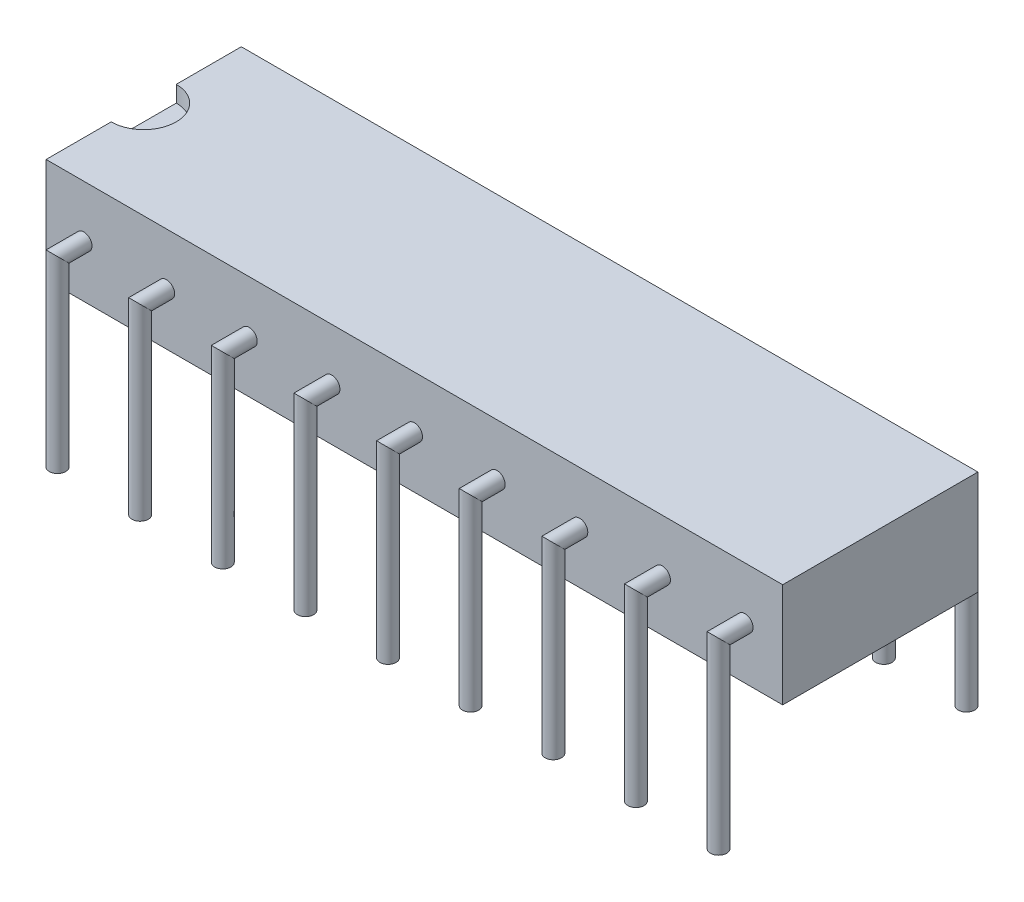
ISO-10303-21;
HEADER;
FILE_DESCRIPTION(('STEP AP214'),'2;1');
FILE_NAME('part.step','',(''),(''),'','','');
FILE_SCHEMA(('AUTOMOTIVE_DESIGN { 1 0 10303 214 1 1 1 1 }'));
ENDSEC;
DATA;
#1=APPLICATION_CONTEXT('core data for automotive mechanical design processes');
#2=APPLICATION_PROTOCOL_DEFINITION('international standard','automotive_design',2000,#1);
#3=PRODUCT_CONTEXT('',#1,'mechanical');
#4=PRODUCT('Part','Part','',(#3));
#5=PRODUCT_RELATED_PRODUCT_CATEGORY('part','',(#4));
#6=PRODUCT_DEFINITION_FORMATION('','',#4);
#7=PRODUCT_DEFINITION_CONTEXT('part definition',#1,'design');
#8=PRODUCT_DEFINITION('design','',#6,#7);
#9=PRODUCT_DEFINITION_SHAPE('','',#8);
#10=(LENGTH_UNIT() NAMED_UNIT(*) SI_UNIT(.MILLI.,.METRE.));
#11=(NAMED_UNIT(*) PLANE_ANGLE_UNIT() SI_UNIT($,.RADIAN.));
#12=(NAMED_UNIT(*) SI_UNIT($,.STERADIAN.) SOLID_ANGLE_UNIT());
#13=UNCERTAINTY_MEASURE_WITH_UNIT(LENGTH_MEASURE(1.E-05),#10,'distance_accuracy_value','');
#14=(GEOMETRIC_REPRESENTATION_CONTEXT(3) GLOBAL_UNCERTAINTY_ASSIGNED_CONTEXT((#13)) GLOBAL_UNIT_ASSIGNED_CONTEXT((#10,
#11,#12)) REPRESENTATION_CONTEXT('',''));
#15=CARTESIAN_POINT('',(0.,0.,0.));
#16=DIRECTION('',(0.,0.,1.));
#17=DIRECTION('',(1.,0.,0.));
#18=AXIS2_PLACEMENT_3D('',#15,#16,#17);
#19=CARTESIAN_POINT('',(22.64,3.2,3.));
#20=DIRECTION('',(0.,0.,-1.));
#21=DIRECTION('',(-1.,0.,0.));
#22=AXIS2_PLACEMENT_3D('',#19,#20,#21);
#23=PLANE('',#22);
#24=CARTESIAN_POINT('',(18.94,1.6,3.));
#25=DIRECTION('',(0.,0.,-1.));
#26=DIRECTION('',(-1.,0.,0.));
#27=AXIS2_PLACEMENT_3D('',#24,#25,#26);
#28=CIRCLE('',#27,0.25);
#29=CARTESIAN_POINT('',(18.69,1.6,3.));
#30=VERTEX_POINT('',#29);
#31=EDGE_CURVE('E59',#30,#30,#28,.F.);
#32=ORIENTED_EDGE('',*,*,#31,.F.);
#33=EDGE_LOOP('',(#32));
#34=FACE_BOUND('',#33,.T.);
#35=CARTESIAN_POINT('',(13.86,1.6,3.));
#36=DIRECTION('',(0.,0.,-1.));
#37=DIRECTION('',(-1.,0.,0.));
#38=AXIS2_PLACEMENT_3D('',#35,#36,#37);
#39=CIRCLE('',#38,0.25);
#40=CARTESIAN_POINT('',(13.61,1.6,3.));
#41=VERTEX_POINT('',#40);
#42=EDGE_CURVE('E171',#41,#41,#39,.F.);
#43=ORIENTED_EDGE('',*,*,#42,.F.);
#44=EDGE_LOOP('',(#43));
#45=FACE_BOUND('',#44,.T.);
#46=CARTESIAN_POINT('',(8.78,1.6,3.));
#47=DIRECTION('',(0.,0.,-1.));
#48=DIRECTION('',(-1.,0.,0.));
#49=AXIS2_PLACEMENT_3D('',#46,#47,#48);
#50=CIRCLE('',#49,0.25);
#51=CARTESIAN_POINT('',(8.53,1.6,3.));
#52=VERTEX_POINT('',#51);
#53=EDGE_CURVE('E165',#52,#52,#50,.F.);
#54=ORIENTED_EDGE('',*,*,#53,.F.);
#55=EDGE_LOOP('',(#54));
#56=FACE_BOUND('',#55,.T.);
#57=CARTESIAN_POINT('',(3.7,1.6,3.));
#58=DIRECTION('',(0.,0.,-1.));
#59=DIRECTION('',(-1.,0.,0.));
#60=AXIS2_PLACEMENT_3D('',#57,#58,#59);
#61=CIRCLE('',#60,0.25);
#62=CARTESIAN_POINT('',(3.45,1.6,3.));
#63=VERTEX_POINT('',#62);
#64=EDGE_CURVE('E159',#63,#63,#61,.F.);
#65=ORIENTED_EDGE('',*,*,#64,.F.);
#66=EDGE_LOOP('',(#65));
#67=FACE_BOUND('',#66,.T.);
#68=DIRECTION('',(0.,-1.,0.));
#69=VECTOR('',#68,1.);
#70=CARTESIAN_POINT('',(0.,3.2,3.));
#71=LINE('',#70,#69);
#72=CARTESIAN_POINT('',(0.,3.2,3.));
#73=VERTEX_POINT('',#72);
#74=CARTESIAN_POINT('',(0.,0.,3.));
#75=VERTEX_POINT('',#74);
#76=EDGE_CURVE('E126',#73,#75,#71,.T.);
#77=ORIENTED_EDGE('',*,*,#76,.T.);
#78=DIRECTION('',(-1.,0.,0.));
#79=VECTOR('',#78,1.);
#80=CARTESIAN_POINT('',(22.64,0.,3.));
#81=LINE('',#80,#79);
#82=CARTESIAN_POINT('',(22.64,0.,3.));
#83=VERTEX_POINT('',#82);
#84=EDGE_CURVE('E154',#83,#75,#81,.T.);
#85=ORIENTED_EDGE('',*,*,#84,.F.);
#86=DIRECTION('',(0.,-1.,0.));
#87=VECTOR('',#86,1.);
#88=CARTESIAN_POINT('',(22.64,3.2,3.));
#89=LINE('',#88,#87);
#90=CARTESIAN_POINT('',(22.64,3.2,3.));
#91=VERTEX_POINT('',#90);
#92=EDGE_CURVE('E134',#91,#83,#89,.T.);
#93=ORIENTED_EDGE('',*,*,#92,.F.);
#94=DIRECTION('',(-1.,0.,0.));
#95=VECTOR('',#94,1.);
#96=CARTESIAN_POINT('',(22.64,3.2,3.));
#97=LINE('',#96,#95);
#98=EDGE_CURVE('E140',#91,#73,#97,.T.);
#99=ORIENTED_EDGE('',*,*,#98,.T.);
#100=EDGE_LOOP('',(#77,#85,#93,#99));
#101=FACE_BOUND('',#100,.T.);
#102=CARTESIAN_POINT('',(1.16,1.6,3.));
#103=DIRECTION('',(0.,0.,-1.));
#104=DIRECTION('',(-1.,0.,0.));
#105=AXIS2_PLACEMENT_3D('',#102,#103,#104);
#106=CIRCLE('',#105,0.25);
#107=CARTESIAN_POINT('',(0.91,1.6,3.));
#108=VERTEX_POINT('',#107);
#109=EDGE_CURVE('E156',#108,#108,#106,.F.);
#110=ORIENTED_EDGE('',*,*,#109,.F.);
#111=EDGE_LOOP('',(#110));
#112=FACE_BOUND('',#111,.T.);
#113=CARTESIAN_POINT('',(6.24,1.6,3.));
#114=DIRECTION('',(0.,0.,-1.));
#115=DIRECTION('',(-1.,0.,0.));
#116=AXIS2_PLACEMENT_3D('',#113,#114,#115);
#117=CIRCLE('',#116,0.25);
#118=CARTESIAN_POINT('',(5.99,1.6,3.));
#119=VERTEX_POINT('',#118);
#120=EDGE_CURVE('E162',#119,#119,#117,.F.);
#121=ORIENTED_EDGE('',*,*,#120,.F.);
#122=EDGE_LOOP('',(#121));
#123=FACE_BOUND('',#122,.T.);
#124=CARTESIAN_POINT('',(11.32,1.6,3.));
#125=DIRECTION('',(0.,0.,-1.));
#126=DIRECTION('',(-1.,0.,0.));
#127=AXIS2_PLACEMENT_3D('',#124,#125,#126);
#128=CIRCLE('',#127,0.25);
#129=CARTESIAN_POINT('',(11.07,1.6,3.));
#130=VERTEX_POINT('',#129);
#131=EDGE_CURVE('E168',#130,#130,#128,.F.);
#132=ORIENTED_EDGE('',*,*,#131,.F.);
#133=EDGE_LOOP('',(#132));
#134=FACE_BOUND('',#133,.T.);
#135=CARTESIAN_POINT('',(16.4,1.6,3.));
#136=DIRECTION('',(0.,0.,-1.));
#137=DIRECTION('',(-1.,0.,0.));
#138=AXIS2_PLACEMENT_3D('',#135,#136,#137);
#139=CIRCLE('',#138,0.25);
#140=CARTESIAN_POINT('',(16.15,1.6,3.));
#141=VERTEX_POINT('',#140);
#142=EDGE_CURVE('E174',#141,#141,#139,.F.);
#143=ORIENTED_EDGE('',*,*,#142,.F.);
#144=EDGE_LOOP('',(#143));
#145=FACE_BOUND('',#144,.T.);
#146=CARTESIAN_POINT('',(21.48,1.6,3.));
#147=DIRECTION('',(0.,0.,-1.));
#148=DIRECTION('',(-1.,0.,0.));
#149=AXIS2_PLACEMENT_3D('',#146,#147,#148);
#150=CIRCLE('',#149,0.25);
#151=CARTESIAN_POINT('',(21.23,1.6,3.));
#152=VERTEX_POINT('',#151);
#153=EDGE_CURVE('E12',#152,#152,#150,.F.);
#154=ORIENTED_EDGE('',*,*,#153,.F.);
#155=EDGE_LOOP('',(#154));
#156=FACE_BOUND('',#155,.T.);
#157=ADVANCED_FACE('F52',(#34,#45,#56,#67,#101,#112,#123,#134,#145,#156),#23,.F.);
#158=CARTESIAN_POINT('',(22.64,0.,3.));
#159=DIRECTION('',(0.,1.,0.));
#160=DIRECTION('',(0.,0.,1.));
#161=AXIS2_PLACEMENT_3D('',#158,#159,#160);
#162=PLANE('',#161);
#163=DIRECTION('',(0.,0.,-1.));
#164=VECTOR('',#163,1.);
#165=CARTESIAN_POINT('',(0.,0.,3.));
#166=LINE('',#165,#164);
#167=CARTESIAN_POINT('',(0.,0.,-3.));
#168=VERTEX_POINT('',#167);
#169=EDGE_CURVE('E129',#75,#168,#166,.T.);
#170=ORIENTED_EDGE('',*,*,#169,.T.);
#171=DIRECTION('',(-1.,0.,0.));
#172=VECTOR('',#171,1.);
#173=CARTESIAN_POINT('',(22.64,0.,-3.));
#174=LINE('',#173,#172);
#175=CARTESIAN_POINT('',(22.64,0.,-3.));
#176=VERTEX_POINT('',#175);
#177=EDGE_CURVE('E151',#176,#168,#174,.T.);
#178=ORIENTED_EDGE('',*,*,#177,.F.);
#179=DIRECTION('',(0.,0.,-1.));
#180=VECTOR('',#179,1.);
#181=CARTESIAN_POINT('',(22.64,0.,3.));
#182=LINE('',#181,#180);
#183=EDGE_CURVE('E103',#83,#176,#182,.T.);
#184=ORIENTED_EDGE('',*,*,#183,.F.);
#185=ORIENTED_EDGE('',*,*,#84,.T.);
#186=EDGE_LOOP('',(#170,#178,#184,#185));
#187=FACE_BOUND('',#186,.T.);
#188=ADVANCED_FACE('F184',(#187),#162,.F.);
#189=CARTESIAN_POINT('',(22.64,3.2,-3.));
#190=DIRECTION('',(0.,0.,1.));
#191=DIRECTION('',(1.,0.,0.));
#192=AXIS2_PLACEMENT_3D('',#189,#190,#191);
#193=PLANE('',#192);
#194=CARTESIAN_POINT('',(21.48,1.6,-3.));
#195=DIRECTION('',(0.,0.,1.));
#196=DIRECTION('',(1.,0.,0.));
#197=AXIS2_PLACEMENT_3D('',#194,#195,#196);
#198=CIRCLE('',#197,0.25);
#199=CARTESIAN_POINT('',(21.73,1.6,-3.));
#200=VERTEX_POINT('',#199);
#201=EDGE_CURVE('E888',#200,#200,#198,.T.);
#202=ORIENTED_EDGE('',*,*,#201,.T.);
#203=EDGE_LOOP('',(#202));
#204=FACE_BOUND('',#203,.T.);
#205=CARTESIAN_POINT('',(18.94,1.6,-3.));
#206=DIRECTION('',(0.,0.,1.));
#207=DIRECTION('',(1.,0.,0.));
#208=AXIS2_PLACEMENT_3D('',#205,#206,#207);
#209=CIRCLE('',#208,0.25);
#210=CARTESIAN_POINT('',(19.19,1.6,-3.));
#211=VERTEX_POINT('',#210);
#212=EDGE_CURVE('E881',#211,#211,#209,.T.);
#213=ORIENTED_EDGE('',*,*,#212,.T.);
#214=EDGE_LOOP('',(#213));
#215=FACE_BOUND('',#214,.T.);
#216=CARTESIAN_POINT('',(16.4,1.6,-3.));
#217=DIRECTION('',(0.,0.,1.));
#218=DIRECTION('',(1.,0.,0.));
#219=AXIS2_PLACEMENT_3D('',#216,#217,#218);
#220=CIRCLE('',#219,0.25);
#221=CARTESIAN_POINT('',(16.65,1.6,-3.));
#222=VERTEX_POINT('',#221);
#223=EDGE_CURVE('E897',#222,#222,#220,.T.);
#224=ORIENTED_EDGE('',*,*,#223,.T.);
#225=EDGE_LOOP('',(#224));
#226=FACE_BOUND('',#225,.T.);
#227=CARTESIAN_POINT('',(13.86,1.6,-3.));
#228=DIRECTION('',(0.,0.,1.));
#229=DIRECTION('',(1.,0.,0.));
#230=AXIS2_PLACEMENT_3D('',#227,#228,#229);
#231=CIRCLE('',#230,0.25);
#232=CARTESIAN_POINT('',(14.11,1.6,-3.));
#233=VERTEX_POINT('',#232);
#234=EDGE_CURVE('E906',#233,#233,#231,.T.);
#235=ORIENTED_EDGE('',*,*,#234,.T.);
#236=EDGE_LOOP('',(#235));
#237=FACE_BOUND('',#236,.T.);
#238=CARTESIAN_POINT('',(11.32,1.6,-3.));
#239=DIRECTION('',(0.,0.,1.));
#240=DIRECTION('',(1.,0.,0.));
#241=AXIS2_PLACEMENT_3D('',#238,#239,#240);
#242=CIRCLE('',#241,0.25);
#243=CARTESIAN_POINT('',(11.57,1.6,-3.));
#244=VERTEX_POINT('',#243);
#245=EDGE_CURVE('E915',#244,#244,#242,.T.);
#246=ORIENTED_EDGE('',*,*,#245,.T.);
#247=EDGE_LOOP('',(#246));
#248=FACE_BOUND('',#247,.T.);
#249=CARTESIAN_POINT('',(8.78,1.6,-3.));
#250=DIRECTION('',(0.,0.,1.));
#251=DIRECTION('',(1.,0.,0.));
#252=AXIS2_PLACEMENT_3D('',#249,#250,#251);
#253=CIRCLE('',#252,0.25);
#254=CARTESIAN_POINT('',(9.03,1.6,-3.));
#255=VERTEX_POINT('',#254);
#256=EDGE_CURVE('E924',#255,#255,#253,.T.);
#257=ORIENTED_EDGE('',*,*,#256,.T.);
#258=EDGE_LOOP('',(#257));
#259=FACE_BOUND('',#258,.T.);
#260=CARTESIAN_POINT('',(6.24,1.6,-3.));
#261=DIRECTION('',(0.,0.,1.));
#262=DIRECTION('',(1.,0.,0.));
#263=AXIS2_PLACEMENT_3D('',#260,#261,#262);
#264=CIRCLE('',#263,0.25);
#265=CARTESIAN_POINT('',(6.49,1.6,-3.));
#266=VERTEX_POINT('',#265);
#267=EDGE_CURVE('E933',#266,#266,#264,.T.);
#268=ORIENTED_EDGE('',*,*,#267,.T.);
#269=EDGE_LOOP('',(#268));
#270=FACE_BOUND('',#269,.T.);
#271=CARTESIAN_POINT('',(3.7,1.6,-3.));
#272=DIRECTION('',(0.,0.,1.));
#273=DIRECTION('',(1.,0.,0.));
#274=AXIS2_PLACEMENT_3D('',#271,#272,#273);
#275=CIRCLE('',#274,0.25);
#276=CARTESIAN_POINT('',(3.95,1.6,-3.));
#277=VERTEX_POINT('',#276);
#278=EDGE_CURVE('E942',#277,#277,#275,.T.);
#279=ORIENTED_EDGE('',*,*,#278,.T.);
#280=EDGE_LOOP('',(#279));
#281=FACE_BOUND('',#280,.T.);
#282=CARTESIAN_POINT('',(1.16,1.6,-3.));
#283=DIRECTION('',(0.,0.,1.));
#284=DIRECTION('',(1.,0.,0.));
#285=AXIS2_PLACEMENT_3D('',#282,#283,#284);
#286=CIRCLE('',#285,0.25);
#287=CARTESIAN_POINT('',(1.41,1.6,-3.));
#288=VERTEX_POINT('',#287);
#289=EDGE_CURVE('E265',#288,#288,#286,.T.);
#290=ORIENTED_EDGE('',*,*,#289,.T.);
#291=EDGE_LOOP('',(#290));
#292=FACE_BOUND('',#291,.T.);
#293=DIRECTION('',(0.,1.,0.));
#294=VECTOR('',#293,1.);
#295=CARTESIAN_POINT('',(0.,3.2,-3.));
#296=LINE('',#295,#294);
#297=CARTESIAN_POINT('',(0.,3.2,-3.));
#298=VERTEX_POINT('',#297);
#299=EDGE_CURVE('E143',#168,#298,#296,.T.);
#300=ORIENTED_EDGE('',*,*,#299,.T.);
#301=DIRECTION('',(-1.,0.,0.));
#302=VECTOR('',#301,1.);
#303=CARTESIAN_POINT('',(22.64,3.2,-3.));
#304=LINE('',#303,#302);
#305=CARTESIAN_POINT('',(22.64,3.2,-3.));
#306=VERTEX_POINT('',#305);
#307=EDGE_CURVE('E148',#306,#298,#304,.T.);
#308=ORIENTED_EDGE('',*,*,#307,.F.);
#309=DIRECTION('',(0.,1.,0.));
#310=VECTOR('',#309,1.);
#311=CARTESIAN_POINT('',(22.64,3.2,-3.));
#312=LINE('',#311,#310);
#313=EDGE_CURVE('E138',#176,#306,#312,.T.);
#314=ORIENTED_EDGE('',*,*,#313,.F.);
#315=ORIENTED_EDGE('',*,*,#177,.T.);
#316=EDGE_LOOP('',(#300,#308,#314,#315));
#317=FACE_BOUND('',#316,.T.);
#318=ADVANCED_FACE('F287',(#204,#215,#226,#237,#248,#259,#270,#281,#292,#317),#193,.F.);
#319=CARTESIAN_POINT('',(22.64,3.2,3.));
#320=DIRECTION('',(0.,-1.,0.));
#321=DIRECTION('',(0.,0.,-1.));
#322=AXIS2_PLACEMENT_3D('',#319,#320,#321);
#323=PLANE('',#322);
#324=DIRECTION('',(0.,0.,1.));
#325=VECTOR('',#324,1.);
#326=CARTESIAN_POINT('',(0.,3.2,3.));
#327=LINE('',#326,#325);
#328=CARTESIAN_POINT('',(0.,3.2,-1.));
#329=VERTEX_POINT('',#328);
#330=EDGE_CURVE('E136',#298,#329,#327,.T.);
#331=ORIENTED_EDGE('',*,*,#330,.T.);
#332=CARTESIAN_POINT('',(0.,3.2,0.));
#333=DIRECTION('',(0.,1.,0.));
#334=DIRECTION('',(0.,0.,1.));
#335=AXIS2_PLACEMENT_3D('',#332,#333,#334);
#336=CIRCLE('',#335,1.);
#337=CARTESIAN_POINT('',(0.,3.2,1.));
#338=VERTEX_POINT('',#337);
#339=EDGE_CURVE('E119',#338,#329,#336,.T.);
#340=ORIENTED_EDGE('',*,*,#339,.F.);
#341=EDGE_CURVE('E95',#338,#73,#327,.T.);
#342=ORIENTED_EDGE('',*,*,#341,.T.);
#343=ORIENTED_EDGE('',*,*,#98,.F.);
#344=DIRECTION('',(0.,0.,1.));
#345=VECTOR('',#344,1.);
#346=CARTESIAN_POINT('',(22.64,3.2,3.));
#347=LINE('',#346,#345);
#348=EDGE_CURVE('E74',#306,#91,#347,.T.);
#349=ORIENTED_EDGE('',*,*,#348,.F.);
#350=ORIENTED_EDGE('',*,*,#307,.T.);
#351=EDGE_LOOP('',(#331,#340,#342,#343,#349,#350));
#352=FACE_BOUND('',#351,.T.);
#353=ADVANCED_FACE('F283',(#352),#323,.F.);
#354=CARTESIAN_POINT('',(22.64,0.,3.));
#355=DIRECTION('',(1.,0.,0.));
#356=DIRECTION('',(0.,0.,-1.));
#357=AXIS2_PLACEMENT_3D('',#354,#355,#356);
#358=PLANE('',#357);
#359=ORIENTED_EDGE('',*,*,#92,.T.);
#360=ORIENTED_EDGE('',*,*,#183,.T.);
#361=ORIENTED_EDGE('',*,*,#313,.T.);
#362=ORIENTED_EDGE('',*,*,#348,.T.);
#363=EDGE_LOOP('',(#359,#360,#361,#362));
#364=FACE_BOUND('',#363,.T.);
#365=ADVANCED_FACE('F289',(#364),#358,.T.);
#366=CARTESIAN_POINT('',(0.,0.,3.));
#367=DIRECTION('',(1.,0.,0.));
#368=DIRECTION('',(0.,0.,-1.));
#369=AXIS2_PLACEMENT_3D('',#366,#367,#368);
#370=PLANE('',#369);
#371=DIRECTION('',(0.,0.,1.));
#372=VECTOR('',#371,1.);
#373=CARTESIAN_POINT('',(0.,2.7,-1.));
#374=LINE('',#373,#372);
#375=CARTESIAN_POINT('',(0.,2.7,-1.));
#376=VERTEX_POINT('',#375);
#377=CARTESIAN_POINT('',(0.,2.7,1.));
#378=VERTEX_POINT('',#377);
#379=EDGE_CURVE('E118',#376,#378,#374,.T.);
#380=ORIENTED_EDGE('',*,*,#379,.F.);
#381=DIRECTION('',(0.,1.,0.));
#382=VECTOR('',#381,1.);
#383=CARTESIAN_POINT('',(0.,2.7,-1.));
#384=LINE('',#383,#382);
#385=EDGE_CURVE('E116',#376,#329,#384,.T.);
#386=ORIENTED_EDGE('',*,*,#385,.T.);
#387=ORIENTED_EDGE('',*,*,#330,.F.);
#388=ORIENTED_EDGE('',*,*,#299,.F.);
#389=ORIENTED_EDGE('',*,*,#169,.F.);
#390=ORIENTED_EDGE('',*,*,#76,.F.);
#391=ORIENTED_EDGE('',*,*,#341,.F.);
#392=DIRECTION('',(0.,1.,0.));
#393=VECTOR('',#392,1.);
#394=CARTESIAN_POINT('',(0.,2.7,1.));
#395=LINE('',#394,#393);
#396=EDGE_CURVE('E114',#378,#338,#395,.T.);
#397=ORIENTED_EDGE('',*,*,#396,.F.);
#398=EDGE_LOOP('',(#380,#386,#387,#388,#389,#390,#391,#397));
#399=FACE_BOUND('',#398,.T.);
#400=ADVANCED_FACE('F124',(#399),#370,.F.);
#401=CARTESIAN_POINT('',(0.,2.7,0.));
#402=DIRECTION('',(0.,1.,0.));
#403=DIRECTION('',(0.,0.,1.));
#404=AXIS2_PLACEMENT_3D('',#401,#402,#403);
#405=CYLINDRICAL_SURFACE('',#404,1.);
#406=ORIENTED_EDGE('',*,*,#339,.T.);
#407=ORIENTED_EDGE('',*,*,#385,.F.);
#408=CARTESIAN_POINT('',(0.,2.7,0.));
#409=DIRECTION('',(0.,1.,0.));
#410=DIRECTION('',(0.,0.,1.));
#411=AXIS2_PLACEMENT_3D('',#408,#409,#410);
#412=CIRCLE('',#411,1.);
#413=EDGE_CURVE('E65',#378,#376,#412,.T.);
#414=ORIENTED_EDGE('',*,*,#413,.F.);
#415=ORIENTED_EDGE('',*,*,#396,.T.);
#416=EDGE_LOOP('',(#406,#407,#414,#415));
#417=FACE_BOUND('',#416,.T.);
#418=ADVANCED_FACE('F112',(#417),#405,.F.);
#419=CARTESIAN_POINT('',(0.,2.7,0.));
#420=DIRECTION('',(0.,1.,0.));
#421=DIRECTION('',(0.,0.,1.));
#422=AXIS2_PLACEMENT_3D('',#419,#420,#421);
#423=PLANE('',#422);
#424=ORIENTED_EDGE('',*,*,#413,.T.);
#425=ORIENTED_EDGE('',*,*,#379,.T.);
#426=EDGE_LOOP('',(#424,#425));
#427=FACE_BOUND('',#426,.T.);
#428=ADVANCED_FACE('F121',(#427),#423,.T.);
#429=CARTESIAN_POINT('',(1.16,1.6,3.81));
#430=DIRECTION('',(0.,-1.,0.));
#431=DIRECTION('',(0.,0.,-1.));
#432=AXIS2_PLACEMENT_3D('',#429,#430,#431);
#433=CYLINDRICAL_SURFACE('',#432,0.25);
#434=CARTESIAN_POINT('',(1.16,1.6,3.81));
#435=DIRECTION('',(0.,-0.707106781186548,0.707106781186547));
#436=DIRECTION('',(0.,-0.707106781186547,-0.707106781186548));
#437=AXIS2_PLACEMENT_3D('',#434,#435,#436);
#438=ELLIPSE('',#437,0.353553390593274,0.25);
#439=CARTESIAN_POINT('',(1.16,1.35,3.56));
#440=VERTEX_POINT('',#439);
#441=EDGE_CURVE('E274',#440,#440,#438,.T.);
#442=ORIENTED_EDGE('',*,*,#441,.T.);
#443=EDGE_LOOP('',(#442));
#444=FACE_BOUND('',#443,.T.);
#445=CARTESIAN_POINT('',(1.16,-4.,3.81));
#446=DIRECTION('',(0.,-1.,0.));
#447=DIRECTION('',(0.,0.,-1.));
#448=AXIS2_PLACEMENT_3D('',#445,#446,#447);
#449=CIRCLE('',#448,0.25);
#450=CARTESIAN_POINT('',(1.16,-4.,3.56));
#451=VERTEX_POINT('',#450);
#452=EDGE_CURVE('E277',#451,#451,#449,.F.);
#453=ORIENTED_EDGE('',*,*,#452,.T.);
#454=EDGE_LOOP('',(#453));
#455=FACE_BOUND('',#454,.T.);
#456=ADVANCED_FACE('F341',(#444,#455),#433,.T.);
#457=CARTESIAN_POINT('',(1.16,1.6,4.51710678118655));
#458=DIRECTION('',(0.,0.,-1.));
#459=DIRECTION('',(-1.,0.,0.));
#460=AXIS2_PLACEMENT_3D('',#457,#458,#459);
#461=CYLINDRICAL_SURFACE('',#460,0.25);
#462=ORIENTED_EDGE('',*,*,#109,.T.);
#463=EDGE_LOOP('',(#462));
#464=FACE_BOUND('',#463,.T.);
#465=ORIENTED_EDGE('',*,*,#441,.F.);
#466=EDGE_LOOP('',(#465));
#467=FACE_BOUND('',#466,.T.);
#468=ADVANCED_FACE('F349',(#464,#467),#461,.T.);
#469=CARTESIAN_POINT('',(1.16,-4.,3.81));
#470=DIRECTION('',(0.,-1.,0.));
#471=DIRECTION('',(0.,0.,-1.));
#472=AXIS2_PLACEMENT_3D('',#469,#470,#471);
#473=PLANE('',#472);
#474=ORIENTED_EDGE('',*,*,#452,.F.);
#475=EDGE_LOOP('',(#474));
#476=FACE_BOUND('',#475,.T.);
#477=ADVANCED_FACE('F359',(#476),#473,.T.);
#478=CARTESIAN_POINT('',(1.16,1.6,-3.81));
#479=DIRECTION('',(0.,-1.,0.));
#480=DIRECTION('',(0.,0.,-1.));
#481=AXIS2_PLACEMENT_3D('',#478,#479,#480);
#482=CYLINDRICAL_SURFACE('',#481,0.25);
#483=CARTESIAN_POINT('',(1.16,1.6,-3.81));
#484=DIRECTION('',(0.,-0.707106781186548,-0.707106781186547));
#485=DIRECTION('',(0.,-0.707106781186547,0.707106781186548));
#486=AXIS2_PLACEMENT_3D('',#483,#484,#485);
#487=ELLIPSE('',#486,0.353553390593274,0.25);
#488=CARTESIAN_POINT('',(1.16,1.35,-3.56));
#489=VERTEX_POINT('',#488);
#490=EDGE_CURVE('E268',#489,#489,#487,.F.);
#491=ORIENTED_EDGE('',*,*,#490,.F.);
#492=EDGE_LOOP('',(#491));
#493=FACE_BOUND('',#492,.T.);
#494=CARTESIAN_POINT('',(1.16,-4.,-3.81));
#495=DIRECTION('',(0.,-1.,0.));
#496=DIRECTION('',(0.,0.,-1.));
#497=AXIS2_PLACEMENT_3D('',#494,#495,#496);
#498=CIRCLE('',#497,0.25);
#499=CARTESIAN_POINT('',(1.16,-4.,-4.06));
#500=VERTEX_POINT('',#499);
#501=EDGE_CURVE('E271',#500,#500,#498,.T.);
#502=ORIENTED_EDGE('',*,*,#501,.F.);
#503=EDGE_LOOP('',(#502));
#504=FACE_BOUND('',#503,.T.);
#505=ADVANCED_FACE('F369',(#493,#504),#482,.T.);
#506=CARTESIAN_POINT('',(1.16,1.6,-4.51710678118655));
#507=DIRECTION('',(0.,0.,1.));
#508=DIRECTION('',(1.,0.,0.));
#509=AXIS2_PLACEMENT_3D('',#506,#507,#508);
#510=CYLINDRICAL_SURFACE('',#509,0.25);
#511=ORIENTED_EDGE('',*,*,#289,.F.);
#512=EDGE_LOOP('',(#511));
#513=FACE_BOUND('',#512,.T.);
#514=ORIENTED_EDGE('',*,*,#490,.T.);
#515=EDGE_LOOP('',(#514));
#516=FACE_BOUND('',#515,.T.);
#517=ADVANCED_FACE('F379',(#513,#516),#510,.T.);
#518=CARTESIAN_POINT('',(1.16,-4.,-3.81));
#519=DIRECTION('',(0.,-1.,0.));
#520=DIRECTION('',(0.,0.,-1.));
#521=AXIS2_PLACEMENT_3D('',#518,#519,#520);
#522=PLANE('',#521);
#523=ORIENTED_EDGE('',*,*,#501,.T.);
#524=EDGE_LOOP('',(#523));
#525=FACE_BOUND('',#524,.T.);
#526=ADVANCED_FACE('F389',(#525),#522,.T.);
#527=CARTESIAN_POINT('',(3.7,1.6,3.81));
#528=DIRECTION('',(0.,-1.,0.));
#529=DIRECTION('',(0.,0.,-1.));
#530=AXIS2_PLACEMENT_3D('',#527,#528,#529);
#531=CYLINDRICAL_SURFACE('',#530,0.25);
#532=CARTESIAN_POINT('',(3.7,1.6,3.81));
#533=DIRECTION('',(0.,-0.707106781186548,0.707106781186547));
#534=DIRECTION('',(0.,-0.707106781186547,-0.707106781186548));
#535=AXIS2_PLACEMENT_3D('',#532,#533,#534);
#536=ELLIPSE('',#535,0.353553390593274,0.25);
#537=CARTESIAN_POINT('',(3.7,1.35,3.56));
#538=VERTEX_POINT('',#537);
#539=EDGE_CURVE('E259',#538,#538,#536,.T.);
#540=ORIENTED_EDGE('',*,*,#539,.T.);
#541=EDGE_LOOP('',(#540));
#542=FACE_BOUND('',#541,.T.);
#543=CARTESIAN_POINT('',(3.7,-4.,3.81));
#544=DIRECTION('',(0.,-1.,0.));
#545=DIRECTION('',(0.,0.,-1.));
#546=AXIS2_PLACEMENT_3D('',#543,#544,#545);
#547=CIRCLE('',#546,0.25);
#548=CARTESIAN_POINT('',(3.7,-4.,3.56));
#549=VERTEX_POINT('',#548);
#550=EDGE_CURVE('E262',#549,#549,#547,.F.);
#551=ORIENTED_EDGE('',*,*,#550,.T.);
#552=EDGE_LOOP('',(#551));
#553=FACE_BOUND('',#552,.T.);
#554=ADVANCED_FACE('F398',(#542,#553),#531,.T.);
#555=CARTESIAN_POINT('',(3.7,1.6,4.51710678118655));
#556=DIRECTION('',(0.,0.,-1.));
#557=DIRECTION('',(-1.,0.,0.));
#558=AXIS2_PLACEMENT_3D('',#555,#556,#557);
#559=CYLINDRICAL_SURFACE('',#558,0.25);
#560=ORIENTED_EDGE('',*,*,#64,.T.);
#561=EDGE_LOOP('',(#560));
#562=FACE_BOUND('',#561,.T.);
#563=ORIENTED_EDGE('',*,*,#539,.F.);
#564=EDGE_LOOP('',(#563));
#565=FACE_BOUND('',#564,.T.);
#566=ADVANCED_FACE('F413',(#562,#565),#559,.T.);
#567=CARTESIAN_POINT('',(3.7,-4.,3.81));
#568=DIRECTION('',(0.,-1.,0.));
#569=DIRECTION('',(0.,0.,-1.));
#570=AXIS2_PLACEMENT_3D('',#567,#568,#569);
#571=PLANE('',#570);
#572=ORIENTED_EDGE('',*,*,#550,.F.);
#573=EDGE_LOOP('',(#572));
#574=FACE_BOUND('',#573,.T.);
#575=ADVANCED_FACE('F422',(#574),#571,.T.);
#576=CARTESIAN_POINT('',(6.24,1.6,3.81));
#577=DIRECTION('',(0.,-1.,0.));
#578=DIRECTION('',(0.,0.,-1.));
#579=AXIS2_PLACEMENT_3D('',#576,#577,#578);
#580=CYLINDRICAL_SURFACE('',#579,0.25);
#581=CARTESIAN_POINT('',(6.24,1.6,3.81));
#582=DIRECTION('',(0.,-0.707106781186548,0.707106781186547));
#583=DIRECTION('',(0.,-0.707106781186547,-0.707106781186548));
#584=AXIS2_PLACEMENT_3D('',#581,#582,#583);
#585=ELLIPSE('',#584,0.353553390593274,0.25);
#586=CARTESIAN_POINT('',(6.24,1.35,3.56));
#587=VERTEX_POINT('',#586);
#588=EDGE_CURVE('E253',#587,#587,#585,.T.);
#589=ORIENTED_EDGE('',*,*,#588,.T.);
#590=EDGE_LOOP('',(#589));
#591=FACE_BOUND('',#590,.T.);
#592=CARTESIAN_POINT('',(6.24,-4.,3.81));
#593=DIRECTION('',(0.,-1.,0.));
#594=DIRECTION('',(0.,0.,-1.));
#595=AXIS2_PLACEMENT_3D('',#592,#593,#594);
#596=CIRCLE('',#595,0.25);
#597=CARTESIAN_POINT('',(6.24,-4.,3.56));
#598=VERTEX_POINT('',#597);
#599=EDGE_CURVE('E256',#598,#598,#596,.F.);
#600=ORIENTED_EDGE('',*,*,#599,.T.);
#601=EDGE_LOOP('',(#600));
#602=FACE_BOUND('',#601,.T.);
#603=ADVANCED_FACE('F431',(#591,#602),#580,.T.);
#604=CARTESIAN_POINT('',(6.24,1.6,4.51710678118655));
#605=DIRECTION('',(0.,0.,-1.));
#606=DIRECTION('',(-1.,0.,0.));
#607=AXIS2_PLACEMENT_3D('',#604,#605,#606);
#608=CYLINDRICAL_SURFACE('',#607,0.25);
#609=ORIENTED_EDGE('',*,*,#120,.T.);
#610=EDGE_LOOP('',(#609));
#611=FACE_BOUND('',#610,.T.);
#612=ORIENTED_EDGE('',*,*,#588,.F.);
#613=EDGE_LOOP('',(#612));
#614=FACE_BOUND('',#613,.T.);
#615=ADVANCED_FACE('F440',(#611,#614),#608,.T.);
#616=CARTESIAN_POINT('',(6.24,-4.,3.81));
#617=DIRECTION('',(0.,-1.,0.));
#618=DIRECTION('',(0.,0.,-1.));
#619=AXIS2_PLACEMENT_3D('',#616,#617,#618);
#620=PLANE('',#619);
#621=ORIENTED_EDGE('',*,*,#599,.F.);
#622=EDGE_LOOP('',(#621));
#623=FACE_BOUND('',#622,.T.);
#624=ADVANCED_FACE('F449',(#623),#620,.T.);
#625=CARTESIAN_POINT('',(8.78,1.6,3.81));
#626=DIRECTION('',(0.,-1.,0.));
#627=DIRECTION('',(0.,0.,-1.));
#628=AXIS2_PLACEMENT_3D('',#625,#626,#627);
#629=CYLINDRICAL_SURFACE('',#628,0.25);
#630=CARTESIAN_POINT('',(8.78,1.6,3.81));
#631=DIRECTION('',(0.,-0.707106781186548,0.707106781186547));
#632=DIRECTION('',(0.,-0.707106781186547,-0.707106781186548));
#633=AXIS2_PLACEMENT_3D('',#630,#631,#632);
#634=ELLIPSE('',#633,0.353553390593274,0.25);
#635=CARTESIAN_POINT('',(8.78,1.35,3.56));
#636=VERTEX_POINT('',#635);
#637=EDGE_CURVE('E247',#636,#636,#634,.T.);
#638=ORIENTED_EDGE('',*,*,#637,.T.);
#639=EDGE_LOOP('',(#638));
#640=FACE_BOUND('',#639,.T.);
#641=CARTESIAN_POINT('',(8.78,-4.,3.81));
#642=DIRECTION('',(0.,-1.,0.));
#643=DIRECTION('',(0.,0.,-1.));
#644=AXIS2_PLACEMENT_3D('',#641,#642,#643);
#645=CIRCLE('',#644,0.25);
#646=CARTESIAN_POINT('',(8.78,-4.,3.56));
#647=VERTEX_POINT('',#646);
#648=EDGE_CURVE('E250',#647,#647,#645,.F.);
#649=ORIENTED_EDGE('',*,*,#648,.T.);
#650=EDGE_LOOP('',(#649));
#651=FACE_BOUND('',#650,.T.);
#652=ADVANCED_FACE('F458',(#640,#651),#629,.T.);
#653=CARTESIAN_POINT('',(8.78,1.6,4.51710678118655));
#654=DIRECTION('',(0.,0.,-1.));
#655=DIRECTION('',(-1.,0.,0.));
#656=AXIS2_PLACEMENT_3D('',#653,#654,#655);
#657=CYLINDRICAL_SURFACE('',#656,0.25);
#658=ORIENTED_EDGE('',*,*,#53,.T.);
#659=EDGE_LOOP('',(#658));
#660=FACE_BOUND('',#659,.T.);
#661=ORIENTED_EDGE('',*,*,#637,.F.);
#662=EDGE_LOOP('',(#661));
#663=FACE_BOUND('',#662,.T.);
#664=ADVANCED_FACE('F467',(#660,#663),#657,.T.);
#665=CARTESIAN_POINT('',(8.78,-4.,3.81));
#666=DIRECTION('',(0.,-1.,0.));
#667=DIRECTION('',(0.,0.,-1.));
#668=AXIS2_PLACEMENT_3D('',#665,#666,#667);
#669=PLANE('',#668);
#670=ORIENTED_EDGE('',*,*,#648,.F.);
#671=EDGE_LOOP('',(#670));
#672=FACE_BOUND('',#671,.T.);
#673=ADVANCED_FACE('F476',(#672),#669,.T.);
#674=CARTESIAN_POINT('',(11.32,1.6,3.81));
#675=DIRECTION('',(0.,-1.,0.));
#676=DIRECTION('',(0.,0.,-1.));
#677=AXIS2_PLACEMENT_3D('',#674,#675,#676);
#678=CYLINDRICAL_SURFACE('',#677,0.25);
#679=CARTESIAN_POINT('',(11.32,1.6,3.81));
#680=DIRECTION('',(0.,-0.707106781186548,0.707106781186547));
#681=DIRECTION('',(0.,-0.707106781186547,-0.707106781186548));
#682=AXIS2_PLACEMENT_3D('',#679,#680,#681);
#683=ELLIPSE('',#682,0.353553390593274,0.25);
#684=CARTESIAN_POINT('',(11.32,1.35,3.56));
#685=VERTEX_POINT('',#684);
#686=EDGE_CURVE('E241',#685,#685,#683,.T.);
#687=ORIENTED_EDGE('',*,*,#686,.T.);
#688=EDGE_LOOP('',(#687));
#689=FACE_BOUND('',#688,.T.);
#690=CARTESIAN_POINT('',(11.32,-4.,3.81));
#691=DIRECTION('',(0.,-1.,0.));
#692=DIRECTION('',(0.,0.,-1.));
#693=AXIS2_PLACEMENT_3D('',#690,#691,#692);
#694=CIRCLE('',#693,0.25);
#695=CARTESIAN_POINT('',(11.32,-4.,3.56));
#696=VERTEX_POINT('',#695);
#697=EDGE_CURVE('E244',#696,#696,#694,.F.);
#698=ORIENTED_EDGE('',*,*,#697,.T.);
#699=EDGE_LOOP('',(#698));
#700=FACE_BOUND('',#699,.T.);
#701=ADVANCED_FACE('F485',(#689,#700),#678,.T.);
#702=CARTESIAN_POINT('',(11.32,1.6,4.51710678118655));
#703=DIRECTION('',(0.,0.,-1.));
#704=DIRECTION('',(-1.,0.,0.));
#705=AXIS2_PLACEMENT_3D('',#702,#703,#704);
#706=CYLINDRICAL_SURFACE('',#705,0.25);
#707=ORIENTED_EDGE('',*,*,#131,.T.);
#708=EDGE_LOOP('',(#707));
#709=FACE_BOUND('',#708,.T.);
#710=ORIENTED_EDGE('',*,*,#686,.F.);
#711=EDGE_LOOP('',(#710));
#712=FACE_BOUND('',#711,.T.);
#713=ADVANCED_FACE('F494',(#709,#712),#706,.T.);
#714=CARTESIAN_POINT('',(11.32,-4.,3.81));
#715=DIRECTION('',(0.,-1.,0.));
#716=DIRECTION('',(0.,0.,-1.));
#717=AXIS2_PLACEMENT_3D('',#714,#715,#716);
#718=PLANE('',#717);
#719=ORIENTED_EDGE('',*,*,#697,.F.);
#720=EDGE_LOOP('',(#719));
#721=FACE_BOUND('',#720,.T.);
#722=ADVANCED_FACE('F503',(#721),#718,.T.);
#723=CARTESIAN_POINT('',(13.86,1.6,3.81));
#724=DIRECTION('',(0.,-1.,0.));
#725=DIRECTION('',(0.,0.,-1.));
#726=AXIS2_PLACEMENT_3D('',#723,#724,#725);
#727=CYLINDRICAL_SURFACE('',#726,0.25);
#728=CARTESIAN_POINT('',(13.86,1.6,3.81));
#729=DIRECTION('',(0.,-0.707106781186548,0.707106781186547));
#730=DIRECTION('',(0.,-0.707106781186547,-0.707106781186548));
#731=AXIS2_PLACEMENT_3D('',#728,#729,#730);
#732=ELLIPSE('',#731,0.353553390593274,0.25);
#733=CARTESIAN_POINT('',(13.86,1.35,3.56));
#734=VERTEX_POINT('',#733);
#735=EDGE_CURVE('E235',#734,#734,#732,.T.);
#736=ORIENTED_EDGE('',*,*,#735,.T.);
#737=EDGE_LOOP('',(#736));
#738=FACE_BOUND('',#737,.T.);
#739=CARTESIAN_POINT('',(13.86,-4.,3.81));
#740=DIRECTION('',(0.,-1.,0.));
#741=DIRECTION('',(0.,0.,-1.));
#742=AXIS2_PLACEMENT_3D('',#739,#740,#741);
#743=CIRCLE('',#742,0.25);
#744=CARTESIAN_POINT('',(13.86,-4.,3.56));
#745=VERTEX_POINT('',#744);
#746=EDGE_CURVE('E238',#745,#745,#743,.F.);
#747=ORIENTED_EDGE('',*,*,#746,.T.);
#748=EDGE_LOOP('',(#747));
#749=FACE_BOUND('',#748,.T.);
#750=ADVANCED_FACE('F512',(#738,#749),#727,.T.);
#751=CARTESIAN_POINT('',(13.86,1.6,4.51710678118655));
#752=DIRECTION('',(0.,0.,-1.));
#753=DIRECTION('',(-1.,0.,0.));
#754=AXIS2_PLACEMENT_3D('',#751,#752,#753);
#755=CYLINDRICAL_SURFACE('',#754,0.25);
#756=ORIENTED_EDGE('',*,*,#42,.T.);
#757=EDGE_LOOP('',(#756));
#758=FACE_BOUND('',#757,.T.);
#759=ORIENTED_EDGE('',*,*,#735,.F.);
#760=EDGE_LOOP('',(#759));
#761=FACE_BOUND('',#760,.T.);
#762=ADVANCED_FACE('F521',(#758,#761),#755,.T.);
#763=CARTESIAN_POINT('',(13.86,-4.,3.81));
#764=DIRECTION('',(0.,-1.,0.));
#765=DIRECTION('',(0.,0.,-1.));
#766=AXIS2_PLACEMENT_3D('',#763,#764,#765);
#767=PLANE('',#766);
#768=ORIENTED_EDGE('',*,*,#746,.F.);
#769=EDGE_LOOP('',(#768));
#770=FACE_BOUND('',#769,.T.);
#771=ADVANCED_FACE('F530',(#770),#767,.T.);
#772=CARTESIAN_POINT('',(16.4,1.6,3.81));
#773=DIRECTION('',(0.,-1.,0.));
#774=DIRECTION('',(0.,0.,-1.));
#775=AXIS2_PLACEMENT_3D('',#772,#773,#774);
#776=CYLINDRICAL_SURFACE('',#775,0.25);
#777=CARTESIAN_POINT('',(16.4,1.6,3.81));
#778=DIRECTION('',(0.,-0.707106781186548,0.707106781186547));
#779=DIRECTION('',(0.,-0.707106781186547,-0.707106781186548));
#780=AXIS2_PLACEMENT_3D('',#777,#778,#779);
#781=ELLIPSE('',#780,0.353553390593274,0.25);
#782=CARTESIAN_POINT('',(16.4,1.35,3.56));
#783=VERTEX_POINT('',#782);
#784=EDGE_CURVE('E229',#783,#783,#781,.T.);
#785=ORIENTED_EDGE('',*,*,#784,.T.);
#786=EDGE_LOOP('',(#785));
#787=FACE_BOUND('',#786,.T.);
#788=CARTESIAN_POINT('',(16.4,-4.,3.81));
#789=DIRECTION('',(0.,-1.,0.));
#790=DIRECTION('',(0.,0.,-1.));
#791=AXIS2_PLACEMENT_3D('',#788,#789,#790);
#792=CIRCLE('',#791,0.25);
#793=CARTESIAN_POINT('',(16.4,-4.,3.56));
#794=VERTEX_POINT('',#793);
#795=EDGE_CURVE('E232',#794,#794,#792,.F.);
#796=ORIENTED_EDGE('',*,*,#795,.T.);
#797=EDGE_LOOP('',(#796));
#798=FACE_BOUND('',#797,.T.);
#799=ADVANCED_FACE('F539',(#787,#798),#776,.T.);
#800=CARTESIAN_POINT('',(16.4,1.6,4.51710678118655));
#801=DIRECTION('',(0.,0.,-1.));
#802=DIRECTION('',(-1.,0.,0.));
#803=AXIS2_PLACEMENT_3D('',#800,#801,#802);
#804=CYLINDRICAL_SURFACE('',#803,0.25);
#805=ORIENTED_EDGE('',*,*,#142,.T.);
#806=EDGE_LOOP('',(#805));
#807=FACE_BOUND('',#806,.T.);
#808=ORIENTED_EDGE('',*,*,#784,.F.);
#809=EDGE_LOOP('',(#808));
#810=FACE_BOUND('',#809,.T.);
#811=ADVANCED_FACE('F548',(#807,#810),#804,.T.);
#812=CARTESIAN_POINT('',(16.4,-4.,3.81));
#813=DIRECTION('',(0.,-1.,0.));
#814=DIRECTION('',(0.,0.,-1.));
#815=AXIS2_PLACEMENT_3D('',#812,#813,#814);
#816=PLANE('',#815);
#817=ORIENTED_EDGE('',*,*,#795,.F.);
#818=EDGE_LOOP('',(#817));
#819=FACE_BOUND('',#818,.T.);
#820=ADVANCED_FACE('F557',(#819),#816,.T.);
#821=CARTESIAN_POINT('',(18.94,1.6,3.81));
#822=DIRECTION('',(0.,-1.,0.));
#823=DIRECTION('',(0.,0.,-1.));
#824=AXIS2_PLACEMENT_3D('',#821,#822,#823);
#825=CYLINDRICAL_SURFACE('',#824,0.25);
#826=CARTESIAN_POINT('',(18.94,1.6,3.81));
#827=DIRECTION('',(0.,-0.707106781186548,0.707106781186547));
#828=DIRECTION('',(0.,-0.707106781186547,-0.707106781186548));
#829=AXIS2_PLACEMENT_3D('',#826,#827,#828);
#830=ELLIPSE('',#829,0.353553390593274,0.25);
#831=CARTESIAN_POINT('',(18.94,1.35,3.56));
#832=VERTEX_POINT('',#831);
#833=EDGE_CURVE('E217',#832,#832,#830,.T.);
#834=ORIENTED_EDGE('',*,*,#833,.T.);
#835=EDGE_LOOP('',(#834));
#836=FACE_BOUND('',#835,.T.);
#837=CARTESIAN_POINT('',(18.94,-4.,3.81));
#838=DIRECTION('',(0.,-1.,0.));
#839=DIRECTION('',(0.,0.,-1.));
#840=AXIS2_PLACEMENT_3D('',#837,#838,#839);
#841=CIRCLE('',#840,0.25);
#842=CARTESIAN_POINT('',(18.94,-4.,3.56));
#843=VERTEX_POINT('',#842);
#844=EDGE_CURVE('E226',#843,#843,#841,.F.);
#845=ORIENTED_EDGE('',*,*,#844,.T.);
#846=EDGE_LOOP('',(#845));
#847=FACE_BOUND('',#846,.T.);
#848=ADVANCED_FACE('F566',(#836,#847),#825,.T.);
#849=CARTESIAN_POINT('',(18.94,1.6,4.51710678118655));
#850=DIRECTION('',(0.,0.,-1.));
#851=DIRECTION('',(-1.,0.,0.));
#852=AXIS2_PLACEMENT_3D('',#849,#850,#851);
#853=CYLINDRICAL_SURFACE('',#852,0.25);
#854=ORIENTED_EDGE('',*,*,#31,.T.);
#855=EDGE_LOOP('',(#854));
#856=FACE_BOUND('',#855,.T.);
#857=ORIENTED_EDGE('',*,*,#833,.F.);
#858=EDGE_LOOP('',(#857));
#859=FACE_BOUND('',#858,.T.);
#860=ADVANCED_FACE('F179',(#856,#859),#853,.T.);
#861=CARTESIAN_POINT('',(18.94,-4.,3.81));
#862=DIRECTION('',(0.,-1.,0.));
#863=DIRECTION('',(0.,0.,-1.));
#864=AXIS2_PLACEMENT_3D('',#861,#862,#863);
#865=PLANE('',#864);
#866=ORIENTED_EDGE('',*,*,#844,.F.);
#867=EDGE_LOOP('',(#866));
#868=FACE_BOUND('',#867,.T.);
#869=ADVANCED_FACE('F583',(#868),#865,.T.);
#870=CARTESIAN_POINT('',(21.48,1.6,3.81));
#871=DIRECTION('',(0.,-1.,0.));
#872=DIRECTION('',(0.,0.,-1.));
#873=AXIS2_PLACEMENT_3D('',#870,#871,#872);
#874=CYLINDRICAL_SURFACE('',#873,0.25);
#875=CARTESIAN_POINT('',(21.48,1.6,3.81));
#876=DIRECTION('',(0.,-0.707106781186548,0.707106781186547));
#877=DIRECTION('',(0.,-0.707106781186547,-0.707106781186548));
#878=AXIS2_PLACEMENT_3D('',#875,#876,#877);
#879=ELLIPSE('',#878,0.353553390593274,0.25);
#880=CARTESIAN_POINT('',(21.48,1.35,3.56));
#881=VERTEX_POINT('',#880);
#882=EDGE_CURVE('E211',#881,#881,#879,.T.);
#883=ORIENTED_EDGE('',*,*,#882,.T.);
#884=EDGE_LOOP('',(#883));
#885=FACE_BOUND('',#884,.T.);
#886=CARTESIAN_POINT('',(21.48,-4.,3.81));
#887=DIRECTION('',(0.,-1.,0.));
#888=DIRECTION('',(0.,0.,-1.));
#889=AXIS2_PLACEMENT_3D('',#886,#887,#888);
#890=CIRCLE('',#889,0.25);
#891=CARTESIAN_POINT('',(21.48,-4.,3.56));
#892=VERTEX_POINT('',#891);
#893=EDGE_CURVE('E213',#892,#892,#890,.F.);
#894=ORIENTED_EDGE('',*,*,#893,.T.);
#895=EDGE_LOOP('',(#894));
#896=FACE_BOUND('',#895,.T.);
#897=ADVANCED_FACE('F207',(#885,#896),#874,.T.);
#898=CARTESIAN_POINT('',(21.48,1.6,4.51710678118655));
#899=DIRECTION('',(0.,0.,-1.));
#900=DIRECTION('',(-1.,0.,0.));
#901=AXIS2_PLACEMENT_3D('',#898,#899,#900);
#902=CYLINDRICAL_SURFACE('',#901,0.25);
#903=ORIENTED_EDGE('',*,*,#153,.T.);
#904=EDGE_LOOP('',(#903));
#905=FACE_BOUND('',#904,.T.);
#906=ORIENTED_EDGE('',*,*,#882,.F.);
#907=EDGE_LOOP('',(#906));
#908=FACE_BOUND('',#907,.T.);
#909=ADVANCED_FACE('F203',(#905,#908),#902,.T.);
#910=CARTESIAN_POINT('',(21.48,-4.,3.81));
#911=DIRECTION('',(0.,-1.,0.));
#912=DIRECTION('',(0.,0.,-1.));
#913=AXIS2_PLACEMENT_3D('',#910,#911,#912);
#914=PLANE('',#913);
#915=ORIENTED_EDGE('',*,*,#893,.F.);
#916=EDGE_LOOP('',(#915));
#917=FACE_BOUND('',#916,.T.);
#918=ADVANCED_FACE('F206',(#917),#914,.T.);
#919=CARTESIAN_POINT('',(3.7,1.6,-3.81));
#920=DIRECTION('',(0.,-1.,0.));
#921=DIRECTION('',(0.,0.,-1.));
#922=AXIS2_PLACEMENT_3D('',#919,#920,#921);
#923=CYLINDRICAL_SURFACE('',#922,0.25);
#924=CARTESIAN_POINT('',(3.7,1.6,-3.81));
#925=DIRECTION('',(0.,-0.707106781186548,-0.707106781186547));
#926=DIRECTION('',(0.,-0.707106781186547,0.707106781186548));
#927=AXIS2_PLACEMENT_3D('',#924,#925,#926);
#928=ELLIPSE('',#927,0.353553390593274,0.25);
#929=CARTESIAN_POINT('',(3.7,1.35,-3.56));
#930=VERTEX_POINT('',#929);
#931=EDGE_CURVE('E220',#930,#930,#928,.F.);
#932=ORIENTED_EDGE('',*,*,#931,.F.);
#933=EDGE_LOOP('',(#932));
#934=FACE_BOUND('',#933,.T.);
#935=CARTESIAN_POINT('',(3.7,-4.,-3.81));
#936=DIRECTION('',(0.,-1.,0.));
#937=DIRECTION('',(0.,0.,-1.));
#938=AXIS2_PLACEMENT_3D('',#935,#936,#937);
#939=CIRCLE('',#938,0.25);
#940=CARTESIAN_POINT('',(3.7,-4.,-4.06));
#941=VERTEX_POINT('',#940);
#942=EDGE_CURVE('E214',#941,#941,#939,.T.);
#943=ORIENTED_EDGE('',*,*,#942,.F.);
#944=EDGE_LOOP('',(#943));
#945=FACE_BOUND('',#944,.T.);
#946=ADVANCED_FACE('F611',(#934,#945),#923,.T.);
#947=CARTESIAN_POINT('',(3.7,1.6,-4.51710678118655));
#948=DIRECTION('',(0.,0.,1.));
#949=DIRECTION('',(1.,0.,0.));
#950=AXIS2_PLACEMENT_3D('',#947,#948,#949);
#951=CYLINDRICAL_SURFACE('',#950,0.25);
#952=ORIENTED_EDGE('',*,*,#278,.F.);
#953=EDGE_LOOP('',(#952));
#954=FACE_BOUND('',#953,.T.);
#955=ORIENTED_EDGE('',*,*,#931,.T.);
#956=EDGE_LOOP('',(#955));
#957=FACE_BOUND('',#956,.T.);
#958=ADVANCED_FACE('F620',(#954,#957),#951,.T.);
#959=CARTESIAN_POINT('',(3.7,-4.,-3.81));
#960=DIRECTION('',(0.,-1.,0.));
#961=DIRECTION('',(0.,0.,-1.));
#962=AXIS2_PLACEMENT_3D('',#959,#960,#961);
#963=PLANE('',#962);
#964=ORIENTED_EDGE('',*,*,#942,.T.);
#965=EDGE_LOOP('',(#964));
#966=FACE_BOUND('',#965,.T.);
#967=ADVANCED_FACE('F629',(#966),#963,.T.);
#968=CARTESIAN_POINT('',(6.24,1.6,-3.81));
#969=DIRECTION('',(0.,-1.,0.));
#970=DIRECTION('',(0.,0.,-1.));
#971=AXIS2_PLACEMENT_3D('',#968,#969,#970);
#972=CYLINDRICAL_SURFACE('',#971,0.25);
#973=CARTESIAN_POINT('',(6.24,1.6,-3.81));
#974=DIRECTION('',(0.,-0.707106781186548,-0.707106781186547));
#975=DIRECTION('',(0.,-0.707106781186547,0.707106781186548));
#976=AXIS2_PLACEMENT_3D('',#973,#974,#975);
#977=ELLIPSE('',#976,0.353553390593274,0.25);
#978=CARTESIAN_POINT('',(6.24,1.35,-3.56));
#979=VERTEX_POINT('',#978);
#980=EDGE_CURVE('E936',#979,#979,#977,.F.);
#981=ORIENTED_EDGE('',*,*,#980,.F.);
#982=EDGE_LOOP('',(#981));
#983=FACE_BOUND('',#982,.T.);
#984=CARTESIAN_POINT('',(6.24,-4.,-3.81));
#985=DIRECTION('',(0.,-1.,0.));
#986=DIRECTION('',(0.,0.,-1.));
#987=AXIS2_PLACEMENT_3D('',#984,#985,#986);
#988=CIRCLE('',#987,0.25);
#989=CARTESIAN_POINT('',(6.24,-4.,-4.06));
#990=VERTEX_POINT('',#989);
#991=EDGE_CURVE('E939',#990,#990,#988,.T.);
#992=ORIENTED_EDGE('',*,*,#991,.F.);
#993=EDGE_LOOP('',(#992));
#994=FACE_BOUND('',#993,.T.);
#995=ADVANCED_FACE('F638',(#983,#994),#972,.T.);
#996=CARTESIAN_POINT('',(6.24,1.6,-4.51710678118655));
#997=DIRECTION('',(0.,0.,1.));
#998=DIRECTION('',(1.,0.,0.));
#999=AXIS2_PLACEMENT_3D('',#996,#997,#998);
#1000=CYLINDRICAL_SURFACE('',#999,0.25);
#1001=ORIENTED_EDGE('',*,*,#267,.F.);
#1002=EDGE_LOOP('',(#1001));
#1003=FACE_BOUND('',#1002,.T.);
#1004=ORIENTED_EDGE('',*,*,#980,.T.);
#1005=EDGE_LOOP('',(#1004));
#1006=FACE_BOUND('',#1005,.T.);
#1007=ADVANCED_FACE('F647',(#1003,#1006),#1000,.T.);
#1008=CARTESIAN_POINT('',(6.24,-4.,-3.81));
#1009=DIRECTION('',(0.,-1.,0.));
#1010=DIRECTION('',(0.,0.,-1.));
#1011=AXIS2_PLACEMENT_3D('',#1008,#1009,#1010);
#1012=PLANE('',#1011);
#1013=ORIENTED_EDGE('',*,*,#991,.T.);
#1014=EDGE_LOOP('',(#1013));
#1015=FACE_BOUND('',#1014,.T.);
#1016=ADVANCED_FACE('F656',(#1015),#1012,.T.);
#1017=CARTESIAN_POINT('',(8.78,1.6,-3.81));
#1018=DIRECTION('',(0.,-1.,0.));
#1019=DIRECTION('',(0.,0.,-1.));
#1020=AXIS2_PLACEMENT_3D('',#1017,#1018,#1019);
#1021=CYLINDRICAL_SURFACE('',#1020,0.25);
#1022=CARTESIAN_POINT('',(8.78,1.6,-3.81));
#1023=DIRECTION('',(0.,-0.707106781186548,-0.707106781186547));
#1024=DIRECTION('',(0.,-0.707106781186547,0.707106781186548));
#1025=AXIS2_PLACEMENT_3D('',#1022,#1023,#1024);
#1026=ELLIPSE('',#1025,0.353553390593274,0.25);
#1027=CARTESIAN_POINT('',(8.78,1.35,-3.56));
#1028=VERTEX_POINT('',#1027);
#1029=EDGE_CURVE('E927',#1028,#1028,#1026,.F.);
#1030=ORIENTED_EDGE('',*,*,#1029,.F.);
#1031=EDGE_LOOP('',(#1030));
#1032=FACE_BOUND('',#1031,.T.);
#1033=CARTESIAN_POINT('',(8.78,-4.,-3.81));
#1034=DIRECTION('',(0.,-1.,0.));
#1035=DIRECTION('',(0.,0.,-1.));
#1036=AXIS2_PLACEMENT_3D('',#1033,#1034,#1035);
#1037=CIRCLE('',#1036,0.25);
#1038=CARTESIAN_POINT('',(8.78,-4.,-4.06));
#1039=VERTEX_POINT('',#1038);
#1040=EDGE_CURVE('E930',#1039,#1039,#1037,.T.);
#1041=ORIENTED_EDGE('',*,*,#1040,.F.);
#1042=EDGE_LOOP('',(#1041));
#1043=FACE_BOUND('',#1042,.T.);
#1044=ADVANCED_FACE('F665',(#1032,#1043),#1021,.T.);
#1045=CARTESIAN_POINT('',(8.78,1.6,-4.51710678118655));
#1046=DIRECTION('',(0.,0.,1.));
#1047=DIRECTION('',(1.,0.,0.));
#1048=AXIS2_PLACEMENT_3D('',#1045,#1046,#1047);
#1049=CYLINDRICAL_SURFACE('',#1048,0.25);
#1050=ORIENTED_EDGE('',*,*,#256,.F.);
#1051=EDGE_LOOP('',(#1050));
#1052=FACE_BOUND('',#1051,.T.);
#1053=ORIENTED_EDGE('',*,*,#1029,.T.);
#1054=EDGE_LOOP('',(#1053));
#1055=FACE_BOUND('',#1054,.T.);
#1056=ADVANCED_FACE('F674',(#1052,#1055),#1049,.T.);
#1057=CARTESIAN_POINT('',(8.78,-4.,-3.81));
#1058=DIRECTION('',(0.,-1.,0.));
#1059=DIRECTION('',(0.,0.,-1.));
#1060=AXIS2_PLACEMENT_3D('',#1057,#1058,#1059);
#1061=PLANE('',#1060);
#1062=ORIENTED_EDGE('',*,*,#1040,.T.);
#1063=EDGE_LOOP('',(#1062));
#1064=FACE_BOUND('',#1063,.T.);
#1065=ADVANCED_FACE('F683',(#1064),#1061,.T.);
#1066=CARTESIAN_POINT('',(11.32,1.6,-3.81));
#1067=DIRECTION('',(0.,-1.,0.));
#1068=DIRECTION('',(0.,0.,-1.));
#1069=AXIS2_PLACEMENT_3D('',#1066,#1067,#1068);
#1070=CYLINDRICAL_SURFACE('',#1069,0.25);
#1071=CARTESIAN_POINT('',(11.32,1.6,-3.81));
#1072=DIRECTION('',(0.,-0.707106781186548,-0.707106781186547));
#1073=DIRECTION('',(0.,-0.707106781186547,0.707106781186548));
#1074=AXIS2_PLACEMENT_3D('',#1071,#1072,#1073);
#1075=ELLIPSE('',#1074,0.353553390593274,0.25);
#1076=CARTESIAN_POINT('',(11.32,1.35,-3.56));
#1077=VERTEX_POINT('',#1076);
#1078=EDGE_CURVE('E918',#1077,#1077,#1075,.F.);
#1079=ORIENTED_EDGE('',*,*,#1078,.F.);
#1080=EDGE_LOOP('',(#1079));
#1081=FACE_BOUND('',#1080,.T.);
#1082=CARTESIAN_POINT('',(11.32,-4.,-3.81));
#1083=DIRECTION('',(0.,-1.,0.));
#1084=DIRECTION('',(0.,0.,-1.));
#1085=AXIS2_PLACEMENT_3D('',#1082,#1083,#1084);
#1086=CIRCLE('',#1085,0.25);
#1087=CARTESIAN_POINT('',(11.32,-4.,-4.06));
#1088=VERTEX_POINT('',#1087);
#1089=EDGE_CURVE('E921',#1088,#1088,#1086,.T.);
#1090=ORIENTED_EDGE('',*,*,#1089,.F.);
#1091=EDGE_LOOP('',(#1090));
#1092=FACE_BOUND('',#1091,.T.);
#1093=ADVANCED_FACE('F692',(#1081,#1092),#1070,.T.);
#1094=CARTESIAN_POINT('',(11.32,1.6,-4.51710678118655));
#1095=DIRECTION('',(0.,0.,1.));
#1096=DIRECTION('',(1.,0.,0.));
#1097=AXIS2_PLACEMENT_3D('',#1094,#1095,#1096);
#1098=CYLINDRICAL_SURFACE('',#1097,0.25);
#1099=ORIENTED_EDGE('',*,*,#245,.F.);
#1100=EDGE_LOOP('',(#1099));
#1101=FACE_BOUND('',#1100,.T.);
#1102=ORIENTED_EDGE('',*,*,#1078,.T.);
#1103=EDGE_LOOP('',(#1102));
#1104=FACE_BOUND('',#1103,.T.);
#1105=ADVANCED_FACE('F701',(#1101,#1104),#1098,.T.);
#1106=CARTESIAN_POINT('',(11.32,-4.,-3.81));
#1107=DIRECTION('',(0.,-1.,0.));
#1108=DIRECTION('',(0.,0.,-1.));
#1109=AXIS2_PLACEMENT_3D('',#1106,#1107,#1108);
#1110=PLANE('',#1109);
#1111=ORIENTED_EDGE('',*,*,#1089,.T.);
#1112=EDGE_LOOP('',(#1111));
#1113=FACE_BOUND('',#1112,.T.);
#1114=ADVANCED_FACE('F710',(#1113),#1110,.T.);
#1115=CARTESIAN_POINT('',(13.86,1.6,-3.81));
#1116=DIRECTION('',(0.,-1.,0.));
#1117=DIRECTION('',(0.,0.,-1.));
#1118=AXIS2_PLACEMENT_3D('',#1115,#1116,#1117);
#1119=CYLINDRICAL_SURFACE('',#1118,0.25);
#1120=CARTESIAN_POINT('',(13.86,1.6,-3.81));
#1121=DIRECTION('',(0.,-0.707106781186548,-0.707106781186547));
#1122=DIRECTION('',(0.,-0.707106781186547,0.707106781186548));
#1123=AXIS2_PLACEMENT_3D('',#1120,#1121,#1122);
#1124=ELLIPSE('',#1123,0.353553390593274,0.25);
#1125=CARTESIAN_POINT('',(13.86,1.35,-3.56));
#1126=VERTEX_POINT('',#1125);
#1127=EDGE_CURVE('E909',#1126,#1126,#1124,.F.);
#1128=ORIENTED_EDGE('',*,*,#1127,.F.);
#1129=EDGE_LOOP('',(#1128));
#1130=FACE_BOUND('',#1129,.T.);
#1131=CARTESIAN_POINT('',(13.86,-4.,-3.81));
#1132=DIRECTION('',(0.,-1.,0.));
#1133=DIRECTION('',(0.,0.,-1.));
#1134=AXIS2_PLACEMENT_3D('',#1131,#1132,#1133);
#1135=CIRCLE('',#1134,0.25);
#1136=CARTESIAN_POINT('',(13.86,-4.,-4.06));
#1137=VERTEX_POINT('',#1136);
#1138=EDGE_CURVE('E912',#1137,#1137,#1135,.T.);
#1139=ORIENTED_EDGE('',*,*,#1138,.F.);
#1140=EDGE_LOOP('',(#1139));
#1141=FACE_BOUND('',#1140,.T.);
#1142=ADVANCED_FACE('F719',(#1130,#1141),#1119,.T.);
#1143=CARTESIAN_POINT('',(13.86,1.6,-4.51710678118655));
#1144=DIRECTION('',(0.,0.,1.));
#1145=DIRECTION('',(1.,0.,0.));
#1146=AXIS2_PLACEMENT_3D('',#1143,#1144,#1145);
#1147=CYLINDRICAL_SURFACE('',#1146,0.25);
#1148=ORIENTED_EDGE('',*,*,#234,.F.);
#1149=EDGE_LOOP('',(#1148));
#1150=FACE_BOUND('',#1149,.T.);
#1151=ORIENTED_EDGE('',*,*,#1127,.T.);
#1152=EDGE_LOOP('',(#1151));
#1153=FACE_BOUND('',#1152,.T.);
#1154=ADVANCED_FACE('F728',(#1150,#1153),#1147,.T.);
#1155=CARTESIAN_POINT('',(13.86,-4.,-3.81));
#1156=DIRECTION('',(0.,-1.,0.));
#1157=DIRECTION('',(0.,0.,-1.));
#1158=AXIS2_PLACEMENT_3D('',#1155,#1156,#1157);
#1159=PLANE('',#1158);
#1160=ORIENTED_EDGE('',*,*,#1138,.T.);
#1161=EDGE_LOOP('',(#1160));
#1162=FACE_BOUND('',#1161,.T.);
#1163=ADVANCED_FACE('F737',(#1162),#1159,.T.);
#1164=CARTESIAN_POINT('',(16.4,1.6,-3.81));
#1165=DIRECTION('',(0.,-1.,0.));
#1166=DIRECTION('',(0.,0.,-1.));
#1167=AXIS2_PLACEMENT_3D('',#1164,#1165,#1166);
#1168=CYLINDRICAL_SURFACE('',#1167,0.25);
#1169=CARTESIAN_POINT('',(16.4,1.6,-3.81));
#1170=DIRECTION('',(0.,-0.707106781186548,-0.707106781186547));
#1171=DIRECTION('',(0.,-0.707106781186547,0.707106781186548));
#1172=AXIS2_PLACEMENT_3D('',#1169,#1170,#1171);
#1173=ELLIPSE('',#1172,0.353553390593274,0.25);
#1174=CARTESIAN_POINT('',(16.4,1.35,-3.56));
#1175=VERTEX_POINT('',#1174);
#1176=EDGE_CURVE('E900',#1175,#1175,#1173,.F.);
#1177=ORIENTED_EDGE('',*,*,#1176,.F.);
#1178=EDGE_LOOP('',(#1177));
#1179=FACE_BOUND('',#1178,.T.);
#1180=CARTESIAN_POINT('',(16.4,-4.,-3.81));
#1181=DIRECTION('',(0.,-1.,0.));
#1182=DIRECTION('',(0.,0.,-1.));
#1183=AXIS2_PLACEMENT_3D('',#1180,#1181,#1182);
#1184=CIRCLE('',#1183,0.25);
#1185=CARTESIAN_POINT('',(16.4,-4.,-4.06));
#1186=VERTEX_POINT('',#1185);
#1187=EDGE_CURVE('E903',#1186,#1186,#1184,.T.);
#1188=ORIENTED_EDGE('',*,*,#1187,.F.);
#1189=EDGE_LOOP('',(#1188));
#1190=FACE_BOUND('',#1189,.T.);
#1191=ADVANCED_FACE('F746',(#1179,#1190),#1168,.T.);
#1192=CARTESIAN_POINT('',(16.4,1.6,-4.51710678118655));
#1193=DIRECTION('',(0.,0.,1.));
#1194=DIRECTION('',(1.,0.,0.));
#1195=AXIS2_PLACEMENT_3D('',#1192,#1193,#1194);
#1196=CYLINDRICAL_SURFACE('',#1195,0.25);
#1197=ORIENTED_EDGE('',*,*,#223,.F.);
#1198=EDGE_LOOP('',(#1197));
#1199=FACE_BOUND('',#1198,.T.);
#1200=ORIENTED_EDGE('',*,*,#1176,.T.);
#1201=EDGE_LOOP('',(#1200));
#1202=FACE_BOUND('',#1201,.T.);
#1203=ADVANCED_FACE('F755',(#1199,#1202),#1196,.T.);
#1204=CARTESIAN_POINT('',(16.4,-4.,-3.81));
#1205=DIRECTION('',(0.,-1.,0.));
#1206=DIRECTION('',(0.,0.,-1.));
#1207=AXIS2_PLACEMENT_3D('',#1204,#1205,#1206);
#1208=PLANE('',#1207);
#1209=ORIENTED_EDGE('',*,*,#1187,.T.);
#1210=EDGE_LOOP('',(#1209));
#1211=FACE_BOUND('',#1210,.T.);
#1212=ADVANCED_FACE('F764',(#1211),#1208,.T.);
#1213=CARTESIAN_POINT('',(18.94,1.6,-3.81));
#1214=DIRECTION('',(0.,-1.,0.));
#1215=DIRECTION('',(0.,0.,-1.));
#1216=AXIS2_PLACEMENT_3D('',#1213,#1214,#1215);
#1217=CYLINDRICAL_SURFACE('',#1216,0.25);
#1218=CARTESIAN_POINT('',(18.94,1.6,-3.81));
#1219=DIRECTION('',(0.,-0.707106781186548,-0.707106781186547));
#1220=DIRECTION('',(0.,-0.707106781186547,0.707106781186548));
#1221=AXIS2_PLACEMENT_3D('',#1218,#1219,#1220);
#1222=ELLIPSE('',#1221,0.353553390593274,0.25);
#1223=CARTESIAN_POINT('',(18.94,1.35,-3.56));
#1224=VERTEX_POINT('',#1223);
#1225=EDGE_CURVE('E885',#1224,#1224,#1222,.F.);
#1226=ORIENTED_EDGE('',*,*,#1225,.F.);
#1227=EDGE_LOOP('',(#1226));
#1228=FACE_BOUND('',#1227,.T.);
#1229=CARTESIAN_POINT('',(18.94,-4.,-3.81));
#1230=DIRECTION('',(0.,-1.,0.));
#1231=DIRECTION('',(0.,0.,-1.));
#1232=AXIS2_PLACEMENT_3D('',#1229,#1230,#1231);
#1233=CIRCLE('',#1232,0.25);
#1234=CARTESIAN_POINT('',(18.94,-4.,-4.06));
#1235=VERTEX_POINT('',#1234);
#1236=EDGE_CURVE('E894',#1235,#1235,#1233,.T.);
#1237=ORIENTED_EDGE('',*,*,#1236,.F.);
#1238=EDGE_LOOP('',(#1237));
#1239=FACE_BOUND('',#1238,.T.);
#1240=ADVANCED_FACE('F773',(#1228,#1239),#1217,.T.);
#1241=CARTESIAN_POINT('',(18.94,1.6,-4.51710678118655));
#1242=DIRECTION('',(0.,0.,1.));
#1243=DIRECTION('',(1.,0.,0.));
#1244=AXIS2_PLACEMENT_3D('',#1241,#1242,#1243);
#1245=CYLINDRICAL_SURFACE('',#1244,0.25);
#1246=ORIENTED_EDGE('',*,*,#212,.F.);
#1247=EDGE_LOOP('',(#1246));
#1248=FACE_BOUND('',#1247,.T.);
#1249=ORIENTED_EDGE('',*,*,#1225,.T.);
#1250=EDGE_LOOP('',(#1249));
#1251=FACE_BOUND('',#1250,.T.);
#1252=ADVANCED_FACE('F782',(#1248,#1251),#1245,.T.);
#1253=CARTESIAN_POINT('',(18.94,-4.,-3.81));
#1254=DIRECTION('',(0.,-1.,0.));
#1255=DIRECTION('',(0.,0.,-1.));
#1256=AXIS2_PLACEMENT_3D('',#1253,#1254,#1255);
#1257=PLANE('',#1256);
#1258=ORIENTED_EDGE('',*,*,#1236,.T.);
#1259=EDGE_LOOP('',(#1258));
#1260=FACE_BOUND('',#1259,.T.);
#1261=ADVANCED_FACE('F791',(#1260),#1257,.T.);
#1262=CARTESIAN_POINT('',(21.48,1.6,-3.81));
#1263=DIRECTION('',(0.,-1.,0.));
#1264=DIRECTION('',(0.,0.,-1.));
#1265=AXIS2_PLACEMENT_3D('',#1262,#1263,#1264);
#1266=CYLINDRICAL_SURFACE('',#1265,0.25);
#1267=CARTESIAN_POINT('',(21.48,1.6,-3.81));
#1268=DIRECTION('',(0.,-0.707106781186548,-0.707106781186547));
#1269=DIRECTION('',(0.,-0.707106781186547,0.707106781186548));
#1270=AXIS2_PLACEMENT_3D('',#1267,#1268,#1269);
#1271=ELLIPSE('',#1270,0.353553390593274,0.25);
#1272=CARTESIAN_POINT('',(21.48,1.35,-3.56));
#1273=VERTEX_POINT('',#1272);
#1274=EDGE_CURVE('E882',#1273,#1273,#1271,.F.);
#1275=ORIENTED_EDGE('',*,*,#1274,.F.);
#1276=EDGE_LOOP('',(#1275));
#1277=FACE_BOUND('',#1276,.T.);
#1278=CARTESIAN_POINT('',(21.48,-4.,-3.81));
#1279=DIRECTION('',(0.,-1.,0.));
#1280=DIRECTION('',(0.,0.,-1.));
#1281=AXIS2_PLACEMENT_3D('',#1278,#1279,#1280);
#1282=CIRCLE('',#1281,0.25);
#1283=CARTESIAN_POINT('',(21.48,-4.,-4.06));
#1284=VERTEX_POINT('',#1283);
#1285=EDGE_CURVE('E879',#1284,#1284,#1282,.T.);
#1286=ORIENTED_EDGE('',*,*,#1285,.F.);
#1287=EDGE_LOOP('',(#1286));
#1288=FACE_BOUND('',#1287,.T.);
#1289=ADVANCED_FACE('F800',(#1277,#1288),#1266,.T.);
#1290=CARTESIAN_POINT('',(21.48,1.6,-4.51710678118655));
#1291=DIRECTION('',(0.,0.,1.));
#1292=DIRECTION('',(1.,0.,0.));
#1293=AXIS2_PLACEMENT_3D('',#1290,#1291,#1292);
#1294=CYLINDRICAL_SURFACE('',#1293,0.25);
#1295=ORIENTED_EDGE('',*,*,#201,.F.);
#1296=EDGE_LOOP('',(#1295));
#1297=FACE_BOUND('',#1296,.T.);
#1298=ORIENTED_EDGE('',*,*,#1274,.T.);
#1299=EDGE_LOOP('',(#1298));
#1300=FACE_BOUND('',#1299,.T.);
#1301=ADVANCED_FACE('F809',(#1297,#1300),#1294,.T.);
#1302=CARTESIAN_POINT('',(21.48,-4.,-3.81));
#1303=DIRECTION('',(0.,-1.,0.));
#1304=DIRECTION('',(0.,0.,-1.));
#1305=AXIS2_PLACEMENT_3D('',#1302,#1303,#1304);
#1306=PLANE('',#1305);
#1307=ORIENTED_EDGE('',*,*,#1285,.T.);
#1308=EDGE_LOOP('',(#1307));
#1309=FACE_BOUND('',#1308,.T.);
#1310=ADVANCED_FACE('F818',(#1309),#1306,.T.);
#1311=CLOSED_SHELL('',(#157,#188,#318,#353,#365,#400,#418,#428,#456,#468,#477,#505,#517,#526,
#554,#566,#575,#603,#615,#624,#652,#664,#673,#701,#713,#722,#750,#762,#771,#799,#811,#820,#848,
#860,#869,#897,#909,#918,#946,#958,#967,#995,#1007,#1016,#1044,#1056,#1065,#1093,#1105,#1114,
#1142,#1154,#1163,#1191,#1203,#1212,#1240,#1252,#1261,#1289,#1301,#1310));
#1312=MANIFOLD_SOLID_BREP('B2',#1311);
#1313=ADVANCED_BREP_SHAPE_REPRESENTATION('',(#18,#1312),#14);
#1314=SHAPE_DEFINITION_REPRESENTATION(#9,#1313);
ENDSEC;
END-ISO-10303-21;
